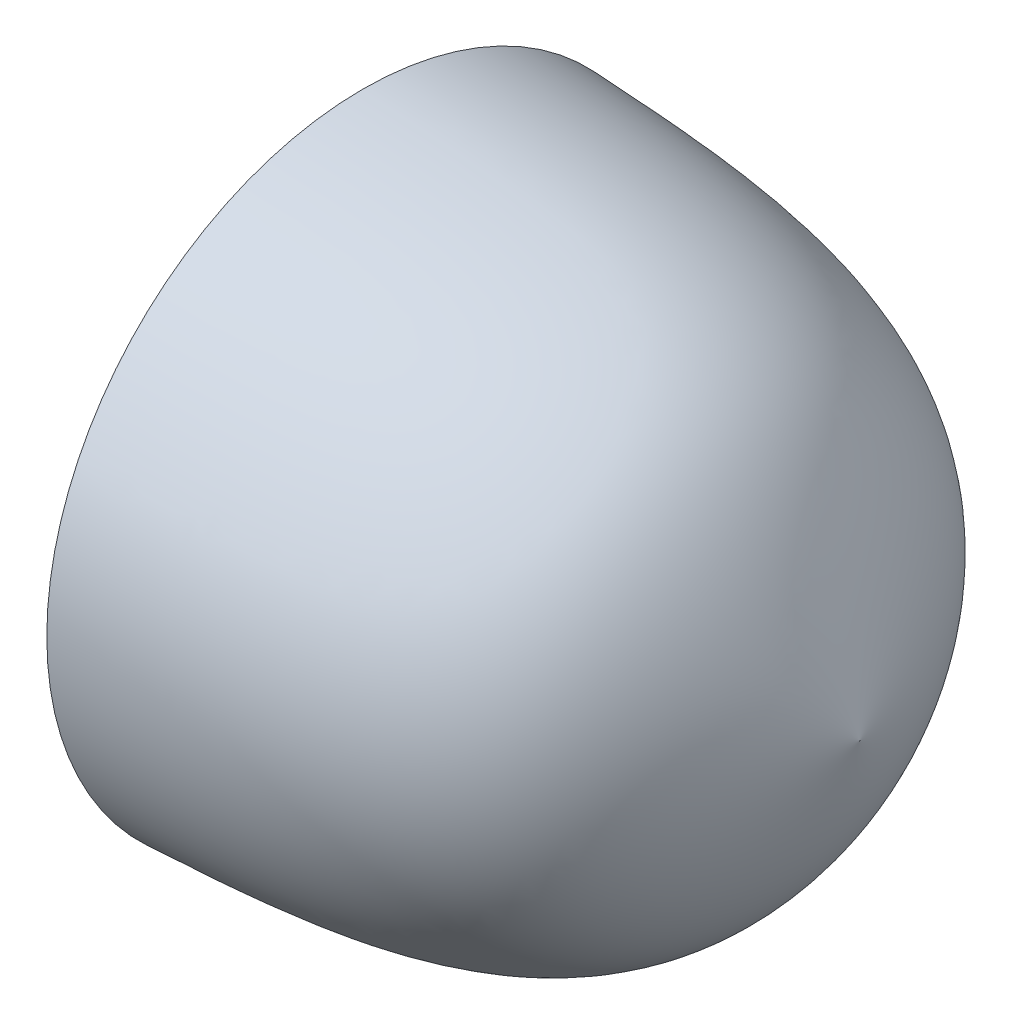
ISO-10303-21;
HEADER;
FILE_DESCRIPTION(('STEP AP214'),'2;1');
FILE_NAME('part.step','',(''),(''),'','','');
FILE_SCHEMA(('AUTOMOTIVE_DESIGN { 1 0 10303 214 1 1 1 1 }'));
ENDSEC;
DATA;
#1=APPLICATION_CONTEXT('core data for automotive mechanical design processes');
#2=APPLICATION_PROTOCOL_DEFINITION('international standard','automotive_design',2000,#1);
#3=PRODUCT_CONTEXT('',#1,'mechanical');
#4=PRODUCT('Part','Part','',(#3));
#5=PRODUCT_RELATED_PRODUCT_CATEGORY('part','',(#4));
#6=PRODUCT_DEFINITION_FORMATION('','',#4);
#7=PRODUCT_DEFINITION_CONTEXT('part definition',#1,'design');
#8=PRODUCT_DEFINITION('design','',#6,#7);
#9=PRODUCT_DEFINITION_SHAPE('','',#8);
#10=(LENGTH_UNIT() NAMED_UNIT(*) SI_UNIT(.MILLI.,.METRE.));
#11=(NAMED_UNIT(*) PLANE_ANGLE_UNIT() SI_UNIT($,.RADIAN.));
#12=(NAMED_UNIT(*) SI_UNIT($,.STERADIAN.) SOLID_ANGLE_UNIT());
#13=UNCERTAINTY_MEASURE_WITH_UNIT(LENGTH_MEASURE(1.E-05),#10,'distance_accuracy_value','');
#14=(GEOMETRIC_REPRESENTATION_CONTEXT(3) GLOBAL_UNCERTAINTY_ASSIGNED_CONTEXT((#13)) GLOBAL_UNIT_ASSIGNED_CONTEXT((#10,
#11,#12)) REPRESENTATION_CONTEXT('',''));
#15=CARTESIAN_POINT('',(0.,0.,0.));
#16=DIRECTION('',(0.,0.,1.));
#17=DIRECTION('',(1.,0.,0.));
#18=AXIS2_PLACEMENT_3D('',#15,#16,#17);
#19=CARTESIAN_POINT('',(47.9479466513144,1.11022302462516E-13,-6.66133814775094E-13));
#20=CARTESIAN_POINT('',(44.7452603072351,9.04509198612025,-2.22044604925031E-13));
#21=CARTESIAN_POINT('',(36.2659020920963,32.9926681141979,-6.66133814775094E-13));
#22=CARTESIAN_POINT('',(9.56426949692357,34.2300081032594,-2.22044604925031E-13));
#23=CARTESIAN_POINT('',(-7.05205334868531,34.9999999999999,-4.44089209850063E-13));
#24=B_SPLINE_CURVE_WITH_KNOTS('',3,(#19,#20,#21,#22,#23),.UNSPECIFIED.,.F.,.F.,(4,1,4),(0.,
0.377703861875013,1.),.UNSPECIFIED.);
#25=CARTESIAN_POINT('',(-52.3886106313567,-2.22044604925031E-13,0.));
#26=DIRECTION('',(-1.,0.,0.));
#27=AXIS1_PLACEMENT('',#25,#26);
#28=SURFACE_OF_REVOLUTION('',#24,#27);
#29=CARTESIAN_POINT('',(-7.05205334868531,-2.22044604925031E-13,-2.22044604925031E-13));
#30=DIRECTION('',(-1.,0.,0.));
#31=DIRECTION('',(0.,0.,1.));
#32=AXIS2_PLACEMENT_3D('',#29,#30,#31);
#33=CIRCLE('',#32,35.);
#34=CARTESIAN_POINT('',(-7.0520533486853,-2.26830442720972E-13,34.9999999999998));
#35=VERTEX_POINT('',#34);
#36=EDGE_CURVE('E13',#35,#35,#33,.T.);
#37=ORIENTED_EDGE('',*,*,#36,.F.);
#38=EDGE_LOOP('',(#37));
#39=FACE_BOUND('',#38,.T.);
#40=CARTESIAN_POINT('',(47.9479466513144,1.11022302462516E-13,-6.66133814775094E-13));
#41=VERTEX_POINT('',#40);
#42=VERTEX_LOOP('',#41);
#43=FACE_BOUND('',#42,.T.);
#44=ADVANCED_FACE('F43',(#39,#43),#28,.T.);
#45=CARTESIAN_POINT('',(-7.05205334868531,5.99999999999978,0.));
#46=DIRECTION('',(1.,0.,0.));
#47=DIRECTION('',(0.,0.,-1.));
#48=AXIS2_PLACEMENT_3D('',#45,#46,#47);
#49=PLANE('',#48);
#50=CARTESIAN_POINT('',(-7.05205334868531,-2.22044604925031E-13,-2.22044604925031E-13));
#51=DIRECTION('',(-1.,0.,0.));
#52=DIRECTION('',(0.,0.,1.));
#53=AXIS2_PLACEMENT_3D('',#50,#51,#52);
#54=CIRCLE('',#53,6.);
#55=CARTESIAN_POINT('',(-7.0520533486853,-2.22865034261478E-13,5.99999999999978));
#56=VERTEX_POINT('',#55);
#57=EDGE_CURVE('E50',#56,#56,#54,.T.);
#58=ORIENTED_EDGE('',*,*,#57,.F.);
#59=EDGE_LOOP('',(#58));
#60=FACE_BOUND('',#59,.T.);
#61=ORIENTED_EDGE('',*,*,#36,.T.);
#62=EDGE_LOOP('',(#61));
#63=FACE_BOUND('',#62,.T.);
#64=ADVANCED_FACE('F54',(#60,#63),#49,.F.);
#65=CARTESIAN_POINT('',(-52.3886106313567,-2.22044604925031E-13,0.));
#66=DIRECTION('',(-1.,0.,0.));
#67=DIRECTION('',(0.,0.,1.));
#68=AXIS2_PLACEMENT_3D('',#65,#66,#67);
#69=CYLINDRICAL_SURFACE('',#68,6.);
#70=CARTESIAN_POINT('',(-27.0520533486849,-2.22044604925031E-13,-2.22044604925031E-13));
#71=DIRECTION('',(-1.,0.,0.));
#72=DIRECTION('',(0.,0.,1.));
#73=AXIS2_PLACEMENT_3D('',#70,#71,#72);
#74=CIRCLE('',#73,6.);
#75=CARTESIAN_POINT('',(-27.0520533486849,-2.22865034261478E-13,5.99999999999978));
#76=VERTEX_POINT('',#75);
#77=EDGE_CURVE('E77',#76,#76,#74,.T.);
#78=ORIENTED_EDGE('',*,*,#77,.F.);
#79=EDGE_LOOP('',(#78));
#80=FACE_BOUND('',#79,.T.);
#81=ORIENTED_EDGE('',*,*,#57,.T.);
#82=EDGE_LOOP('',(#81));
#83=FACE_BOUND('',#82,.T.);
#84=ADVANCED_FACE('F59',(#80,#83),#69,.T.);
#85=CARTESIAN_POINT('',(-27.0520533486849,-2.22044604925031E-13,-2.22044604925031E-13));
#86=DIRECTION('',(1.,0.,0.));
#87=DIRECTION('',(0.,0.,-1.));
#88=AXIS2_PLACEMENT_3D('',#85,#86,#87);
#89=PLANE('',#88);
#90=ORIENTED_EDGE('',*,*,#77,.T.);
#91=EDGE_LOOP('',(#90));
#92=FACE_BOUND('',#91,.T.);
#93=ADVANCED_FACE('F66',(#92),#89,.F.);
#94=CLOSED_SHELL('',(#44,#64,#84,#93));
#95=MANIFOLD_SOLID_BREP('B2',#94);
#96=ADVANCED_BREP_SHAPE_REPRESENTATION('',(#18,#95),#14);
#97=SHAPE_DEFINITION_REPRESENTATION(#9,#96);
ENDSEC;
END-ISO-10303-21;
